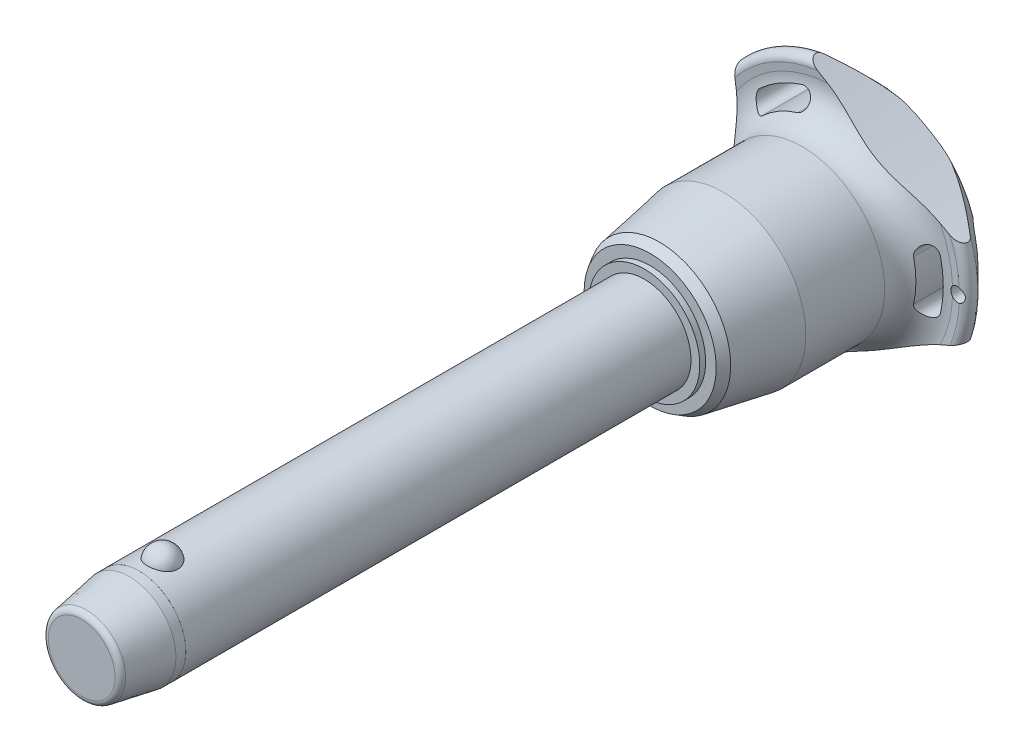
from build123d import *

# Parameters (mm, degrees)
SKETCH1_R           = 10
BOSS_EXTRUDE1_DEPTH = 100
SKETCH2_R           = 8.75
BOSS_EXTRUDE2_DEPTH = 50.7
BOSS_EXTRUDE3_START = 20.5
SKETCH1_2_R         = 10
BOSS_EXTRUDE3_DEPTH = 20.5
CHAMFER1_SIZE       = 10.25
CHAMFER1_SIZE2      = 1.807351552
FILLET1_R           = 1.25
SKETCH6_R           = 176.92625
CUT_EXTRUDE1_DEPTH  = 157.015516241
CIRPATTERN1_COUNT   = 3
SKETCH7_R           = 1.5
CUT_EXTRUDE2_DEPTH  = 156.917913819
SKETCH8_R           = 10
SKETCH8_R_2         = 9.99
CUT_EXTRUDE3_DEPTH  = 12.3


with BuildPart() as part:
    # Sketch1 → Boss-Extrude1 (new body)
    with BuildSketch(Plane.XY):
        Circle(SKETCH1_R)
    extrude(amount=-BOSS_EXTRUDE1_DEPTH)

    # Sketch2 → Boss-Extrude2 (add)
    with BuildSketch(Plane(origin=(0, 0, -100), x_dir=(-1, 0, 0), z_dir=(0, 0, -1))):
        with Locations(Location((0, 0, 0), (0, 0, 180))):
            Circle(SKETCH2_R)
    extrude(amount=BOSS_EXTRUDE2_DEPTH)

    # Sketch3 → Revolve1 (revolve)
    with BuildSketch(Plane(origin=(0, 0, 0), x_dir=(0, 0, -1), z_dir=(1, 0, 0))):
        with BuildLine():
            Line((-3.201562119, 12.5), (-3.201562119, 5.9))
            ThreePointArc((-3.201562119, 5.9), (0.098437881, 9.2), (-3.201562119, 12.5))
        make_face()
        with BuildLine():
            Line((-3.201562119, -5.9), (-3.201562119, -12.5))
            ThreePointArc((-3.201562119, -12.5), (0.098437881, -9.2), (-3.201562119, -5.9))
        make_face()
    revolve(axis=Axis((0, -5.9, 3.201562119), (0, 1, 0)))

    # Sketch1_2 → Boss-Extrude3 (add)
    with BuildSketch(Plane.XY.offset(BOSS_EXTRUDE3_START)):
        Circle(SKETCH1_2_R)
    extrude(amount=-BOSS_EXTRUDE3_DEPTH)

    # Chamfer1
    chamfer1_edges = [part.edges().sort_by_distance(p)[0] for p in [
        (-10, 0, 20.5),
    ]]
    chamfer1_side = [part.faces().sort_by_distance(p)[0] for p in [
        (-10, 0, -39.75),
    ]]
    chamfer(chamfer1_edges, length=CHAMFER1_SIZE, length2=CHAMFER1_SIZE2, reference=chamfer1_side[0])

    # Fillet1
    fillet1_edges = [part.edges().sort_by_distance(p)[0] for p in [
        (-8.192648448, 0, 20.5),
        (-8.75, 0, -150.7),
    ]]
    fillet(fillet1_edges, radius=FILLET1_R)

    # Sketch4 → Revolve2 (revolve)
    with BuildSketch(Plane(origin=(0, 0, 0), x_dir=(0, 0, -1), z_dir=(1, 0, 0)), mode=Mode.PRIVATE) as revolve2_sk:
        Polygon((100, 0), (100, 11.888848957), (101.25, 11.888848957), (101.25, 14.153854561), (103.211552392, 15.286357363), (116.9, 17.7), (133.8, 17.7), (133.8, 0), align=None)
    revolve(revolve2_sk.sketch.rotate(Axis((0, 0, -133.8), (0, 0, 1)), 90), axis=Axis((0, 0, -133.8), (0, 0, 1)))

    # Sketch5 → Revolve3 (revolve)
    with BuildSketch(Plane(origin=(0, 0, 0), x_dir=(0, 0, -1), z_dir=(1, 0, 0)), mode=Mode.PRIVATE) as revolve3_sk:
        with BuildLine():
            Line((140.778589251, 25.247075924), (140.654893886, 26.824954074))
            ThreePointArc((140.654893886, 26.824954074), (141.580366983, 28.40313166), (143.38137085, 28.08137085))
            Line((143.38137085, 28.08137085), (149.763226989, 21.69951471))
            ThreePointArc((149.763226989, 21.69951471), (150.7, 19.381044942), (149.683055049, 17.096604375))
            ThreePointArc((149.683055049, 17.096604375), (144.18864484, 9.321268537), (142.25, 0))
            Line((142.25, 0), (133.8, 0))
            Line((133.8, 0), (133.8, 17.7))
            ThreePointArc((133.8, 17.7), (138.939529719, 19.947607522), (140.778589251, 25.247075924))
        make_face()
    revolve(revolve3_sk.sketch.rotate(Axis((0, 0, -142.25), (0, 0, 1)), 90), axis=Axis((0, 0, -142.25), (0, 0, 1)))

    # Sketch6 → Cut-Extrude1 (cut, through all)
    with BuildSketch(Plane.XY):
        with Locations((-197.42625, 0)):
            Circle(SKETCH6_R)
        with BuildLine():
            ThreePointArc((22.762066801, -5.252833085), (23.360306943, 0), (22.762066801, 5.252833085))
            ThreePointArc((22.762066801, 5.252833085), (20.499354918, 6.667021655), (19.085166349, 4.404309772))
            ThreePointArc((19.085166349, 4.404309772), (19.586768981, 0), (19.085166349, -4.404309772))
            ThreePointArc((19.085166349, -4.404309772), (20.499354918, -6.667021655), (22.762066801, -5.252833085))
        make_face()
    cut_extrude1 = extrude(amount=-CUT_EXTRUDE1_DEPTH, mode=Mode.SUBTRACT)

    # CirPattern1: Cut-Extrude1 ×3 about axis
    cirpattern1_axis = Axis((0, 0, 0), (0, 0, 1))
    for i in range(1, CIRPATTERN1_COUNT):
        add(cut_extrude1.rotate(cirpattern1_axis, i * 360 / CIRPATTERN1_COUNT), mode=Mode.SUBTRACT)

    # Sketch7 → Cut-Extrude2 (cut, through all)
    with BuildSketch(Plane.XY):
        with Locations(Location((26.360306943, 0, 0), (0, 0, 286.501656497))):
            Circle(SKETCH7_R)
    extrude(amount=-CUT_EXTRUDE2_DEPTH, mode=Mode.SUBTRACT)

    # Sketch8 → Cut-Extrude3 (cut)
    with BuildSketch(Plane.XY.offset(20.5)):
        Circle(SKETCH8_R)
        Circle(SKETCH8_R_2, mode=Mode.SUBTRACT)
    extrude(amount=-CUT_EXTRUDE3_DEPTH, mode=Mode.SUBTRACT)


solid = part.part
